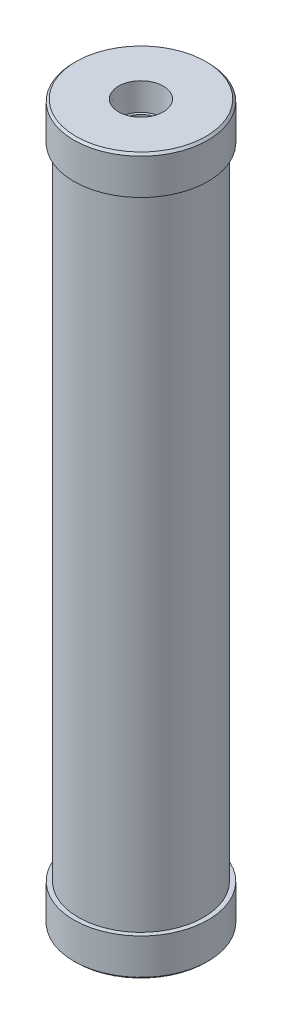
from build123d import *

# Parameters (mm, degrees)
SKETCH1_R           = 44.45
SKETCH1_R_2         = 38.6334
BOSS_EXTRUDE1_DEPTH = 508
SKETCH2_R           = 47.625
BOSS_EXTRUDE2_DEPTH = 26.924
BOSS_EXTRUDE3_START = -26.924
SKETCH5_R           = 47.625
BOSS_EXTRUDE3_DEPTH = 26.924
CHAMFER1_SIZE       = 1.524


with BuildPart() as part:
    # Sketch1 → Boss-Extrude1 (new body)
    with BuildSketch(Plane(origin=(0, 0, 0), x_dir=(1, 0, 0), z_dir=(0, 1, 0))):
        with Locations(Location((0, 0, 0), (0, 0, 270))):
            Circle(SKETCH1_R)
        with Locations(Location((0, 0, 0), (0, 0, 270))):
            Circle(SKETCH1_R_2, mode=Mode.SUBTRACT)
    extrude(amount=BOSS_EXTRUDE1_DEPTH)

    # Sketch2 → Boss-Extrude2 (add)
    with BuildSketch(Plane(origin=(0, 0, 0), x_dir=(1, 0, 0), z_dir=(0, 1, 0))):
        with Locations(Location((0, 0, 0), (0, 0, 270))):
            Circle(SKETCH2_R)
    extrude(amount=BOSS_EXTRUDE2_DEPTH)

    # Sketch3 → 1 Rc Tapped Hole1 (revolve, cut)
    with BuildSketch(Plane(origin=(0, 0, 0), x_dir=(0, 0, -1), z_dir=(1, 0, 0))):
        Polygon((0, 0), (0, 38.591618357), (13.5, 30.48), (13.5, 19.05), (15.291884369, 19.05), (15.886561, 0), align=None)
    revolve(axis=Axis((0, -6.35, 0), (0, 1, 0)), mode=Mode.SUBTRACT)

    # Sketch5 → Boss-Extrude3 (add)
    with BuildSketch(Plane(origin=(0, 508, 0), x_dir=(1, 0, 0), z_dir=(0, 1, 0)).offset(BOSS_EXTRUDE3_START)):
        with Locations(Location((0, 0, 0), (0, 0, 270))):
            Circle(SKETCH5_R)
    extrude(amount=BOSS_EXTRUDE3_DEPTH)

    # Sketch6 → 1 Rc Tapped Hole2 (revolve, cut)
    with BuildSketch(Plane(origin=(0, 508, 0), x_dir=(0, 0, 1), z_dir=(1, 0, 0))):
        Polygon((0, 0), (0, 38.591618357), (13.5, 30.48), (13.5, 19.05), (15.291884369, 19.05), (15.886561, 0), align=None)
    revolve(axis=Axis((0, 514.35, 0), (0, -1, 0)), mode=Mode.SUBTRACT)

    # Chamfer1
    chamfer1_edges = [part.edges().sort_by_distance(p)[0] for p in [
        (0, 0, -47.625),
        (0, 508, -47.625),
    ]]
    chamfer(chamfer1_edges, length=CHAMFER1_SIZE)


solid = part.part
